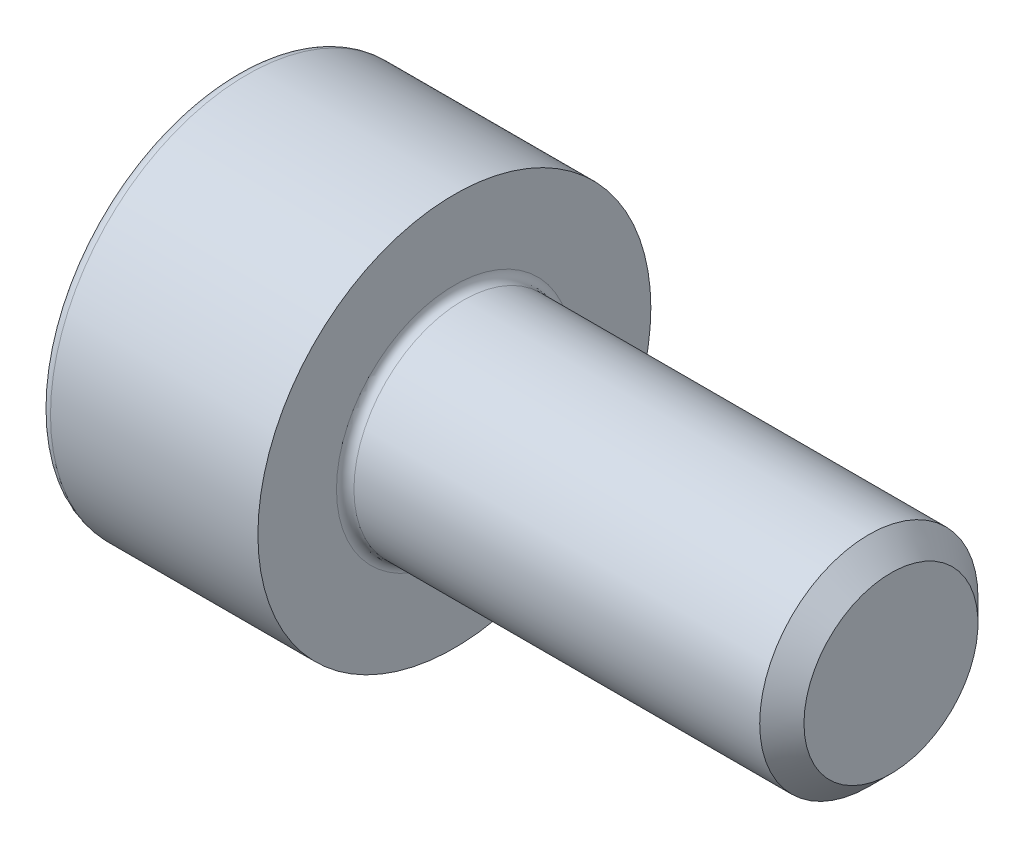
from build123d import *

# Parameters (mm, degrees)
FILLET1_R   = 0.1
FILLET2_R   = 0.125
HEX_2_DEPTH = 1.1


with BuildPart() as part:
    # BodySke → Base-Revolve (revolve)
    with BuildSketch(Plane.XY, mode=Mode.PRIVATE) as base_revolve_sk:
        Polygon((0, 0), (0, 2.25), (2.5, 2.25), (2.5, 1.25), (7.2465, 1.25), (7.5, 0.9965), (7.5, 0), align=None)
    revolve(base_revolve_sk.sketch.rotate(Axis((-31.75, 0, 0), (1, 0, 0)), 90), axis=Axis((-31.75, 0, 0), (1, 0, 0)))

    # Fillet1
    fillet1_edges = [part.edges().sort_by_distance(p)[0] for p in [
        (2.5, 0, -1.25),
    ]]
    fillet(fillet1_edges, radius=FILLET1_R)

    # Fillet2
    fillet2_edges = [part.edges().sort_by_distance(p)[0] for p in [
        (0, 0, -2.25),
    ]]
    fillet(fillet2_edges, radius=FILLET2_R)

    # Sketch2 → Hex-PreBroach (revolve, cut)
    with BuildSketch(Plane.XY, mode=Mode.PRIVATE) as hex_prebroach_sk:
        Polygon((0, 1.0225), (1.1, 1.0225), (1.69034065, 0), (0, 0), align=None)
    revolve(hex_prebroach_sk.sketch.rotate(Axis((0, 0, 0), (1, 0, 0)), 90), axis=Axis((0, 0, 0), (1, 0, 0)), mode=Mode.SUBTRACT)

    # Sketch3 → Hex 2 (cut)
    with BuildSketch(Plane(origin=(0, 0, 0), x_dir=(0, 0.500000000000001, 0.866025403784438), z_dir=(-1, 0, 0))):
        Polygon((0.59034065, 1.0225), (-0.59034065, 1.0225), (-1.1806813, 0), (-0.59034065, -1.0225), (0.59034065, -1.0225), (1.1806813, 0), align=None)
    extrude(amount=-HEX_2_DEPTH, mode=Mode.SUBTRACT)


solid = part.part
